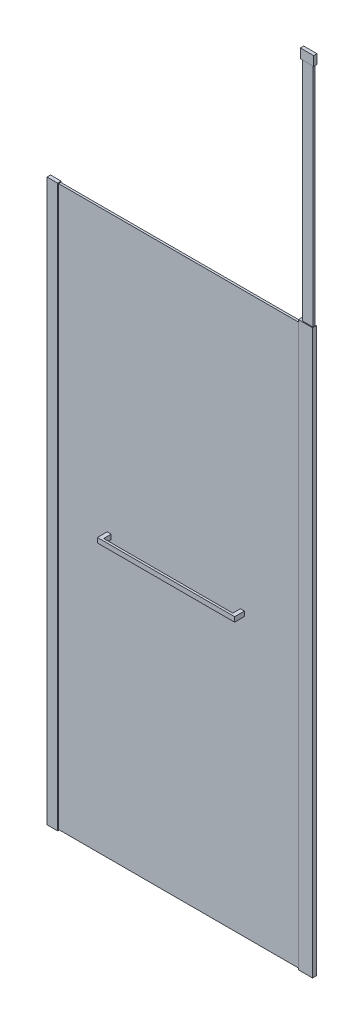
ISO-10303-21;
HEADER;
FILE_DESCRIPTION(('STEP AP214'),'2;1');
FILE_NAME('part.step','',(''),(''),'','','');
FILE_SCHEMA(('AUTOMOTIVE_DESIGN { 1 0 10303 214 1 1 1 1 }'));
ENDSEC;
DATA;
#1=APPLICATION_CONTEXT('core data for automotive mechanical design processes');
#2=APPLICATION_PROTOCOL_DEFINITION('international standard','automotive_design',2000,#1);
#3=PRODUCT_CONTEXT('',#1,'mechanical');
#4=PRODUCT('Part','Part','',(#3));
#5=PRODUCT_RELATED_PRODUCT_CATEGORY('part','',(#4));
#6=PRODUCT_DEFINITION_FORMATION('','',#4);
#7=PRODUCT_DEFINITION_CONTEXT('part definition',#1,'design');
#8=PRODUCT_DEFINITION('design','',#6,#7);
#9=PRODUCT_DEFINITION_SHAPE('','',#8);
#10=(LENGTH_UNIT() NAMED_UNIT(*) SI_UNIT(.MILLI.,.METRE.));
#11=(NAMED_UNIT(*) PLANE_ANGLE_UNIT() SI_UNIT($,.RADIAN.));
#12=(NAMED_UNIT(*) SI_UNIT($,.STERADIAN.) SOLID_ANGLE_UNIT());
#13=UNCERTAINTY_MEASURE_WITH_UNIT(LENGTH_MEASURE(1.E-05),#10,'distance_accuracy_value','');
#14=(GEOMETRIC_REPRESENTATION_CONTEXT(3) GLOBAL_UNCERTAINTY_ASSIGNED_CONTEXT((#13)) GLOBAL_UNIT_ASSIGNED_CONTEXT((#10,
#11,#12)) REPRESENTATION_CONTEXT('',''));
#15=CARTESIAN_POINT('',(0.,0.,0.));
#16=DIRECTION('',(0.,0.,1.));
#17=DIRECTION('',(1.,0.,0.));
#18=AXIS2_PLACEMENT_3D('',#15,#16,#17);
#19=CARTESIAN_POINT('',(237.5,1062.,-21.4));
#20=DIRECTION('',(1.,0.,0.));
#21=DIRECTION('',(0.,0.,-1.));
#22=AXIS2_PLACEMENT_3D('',#19,#20,#21);
#23=PLANE('',#22);
#24=DIRECTION('',(0.,1.,0.));
#25=VECTOR('',#24,1.);
#26=CARTESIAN_POINT('',(237.5,1062.,25.1));
#27=LINE('',#26,#25);
#28=CARTESIAN_POINT('',(237.5,1044.,25.1));
#29=VERTEX_POINT('',#28);
#30=CARTESIAN_POINT('',(237.5,1062.,25.1));
#31=VERTEX_POINT('',#30);
#32=EDGE_CURVE('E63',#29,#31,#27,.T.);
#33=ORIENTED_EDGE('',*,*,#32,.F.);
#34=DIRECTION('',(0.,0.,1.));
#35=VECTOR('',#34,1.);
#36=CARTESIAN_POINT('',(237.5,1044.,-21.4));
#37=LINE('',#36,#35);
#38=CARTESIAN_POINT('',(237.5,1044.,-21.4));
#39=VERTEX_POINT('',#38);
#40=EDGE_CURVE('E12',#39,#29,#37,.T.);
#41=ORIENTED_EDGE('',*,*,#40,.F.);
#42=DIRECTION('',(0.,1.,0.));
#43=VECTOR('',#42,1.);
#44=CARTESIAN_POINT('',(237.5,1062.,-21.4));
#45=LINE('',#44,#43);
#46=CARTESIAN_POINT('',(237.5,1062.,-21.4));
#47=VERTEX_POINT('',#46);
#48=EDGE_CURVE('E193',#39,#47,#45,.T.);
#49=ORIENTED_EDGE('',*,*,#48,.T.);
#50=DIRECTION('',(0.,0.,1.));
#51=VECTOR('',#50,1.);
#52=CARTESIAN_POINT('',(237.5,1062.,-21.4));
#53=LINE('',#52,#51);
#54=EDGE_CURVE('E176',#47,#31,#53,.T.);
#55=ORIENTED_EDGE('',*,*,#54,.T.);
#56=EDGE_LOOP('',(#33,#41,#49,#55));
#57=FACE_BOUND('',#56,.T.);
#58=ADVANCED_FACE('F46',(#57),#23,.T.);
#59=CARTESIAN_POINT('',(222.5,1044.,-21.4));
#60=DIRECTION('',(0.,-1.,0.));
#61=DIRECTION('',(0.,0.,-1.));
#62=AXIS2_PLACEMENT_3D('',#59,#60,#61);
#63=PLANE('',#62);
#64=ORIENTED_EDGE('',*,*,#40,.T.);
#65=DIRECTION('',(-1.,0.,0.));
#66=VECTOR('',#65,1.);
#67=CARTESIAN_POINT('',(742.197715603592,1044.,25.1));
#68=LINE('',#67,#66);
#69=CARTESIAN_POINT('',(722.5,1044.,25.1));
#70=VERTEX_POINT('',#69);
#71=EDGE_CURVE('E166',#70,#29,#68,.T.);
#72=ORIENTED_EDGE('',*,*,#71,.F.);
#73=DIRECTION('',(0.,0.,1.));
#74=VECTOR('',#73,1.);
#75=CARTESIAN_POINT('',(722.5,1044.,-21.4));
#76=LINE('',#75,#74);
#77=CARTESIAN_POINT('',(722.5,1044.,-21.4));
#78=VERTEX_POINT('',#77);
#79=EDGE_CURVE('E149',#78,#70,#76,.T.);
#80=ORIENTED_EDGE('',*,*,#79,.F.);
#81=DIRECTION('',(1.,0.,0.));
#82=VECTOR('',#81,1.);
#83=CARTESIAN_POINT('',(722.5,1044.,-21.4));
#84=LINE('',#83,#82);
#85=CARTESIAN_POINT('',(737.5,1044.,-21.4));
#86=VERTEX_POINT('',#85);
#87=EDGE_CURVE('E131',#78,#86,#84,.T.);
#88=ORIENTED_EDGE('',*,*,#87,.T.);
#89=DIRECTION('',(0.,0.,1.));
#90=VECTOR('',#89,1.);
#91=CARTESIAN_POINT('',(737.5,1044.,-21.4));
#92=LINE('',#91,#90);
#93=CARTESIAN_POINT('',(737.5,1044.,33.1));
#94=VERTEX_POINT('',#93);
#95=EDGE_CURVE('E147',#86,#94,#92,.T.);
#96=ORIENTED_EDGE('',*,*,#95,.T.);
#97=DIRECTION('',(1.,0.,0.));
#98=VECTOR('',#97,1.);
#99=CARTESIAN_POINT('',(222.5,1044.,33.1));
#100=LINE('',#99,#98);
#101=CARTESIAN_POINT('',(222.5,1044.,33.1));
#102=VERTEX_POINT('',#101);
#103=EDGE_CURVE('E135',#102,#94,#100,.T.);
#104=ORIENTED_EDGE('',*,*,#103,.F.);
#105=DIRECTION('',(0.,0.,1.));
#106=VECTOR('',#105,1.);
#107=CARTESIAN_POINT('',(222.5,1044.,-21.4));
#108=LINE('',#107,#106);
#109=CARTESIAN_POINT('',(222.5,1044.,-21.4));
#110=VERTEX_POINT('',#109);
#111=EDGE_CURVE('E55',#110,#102,#108,.T.);
#112=ORIENTED_EDGE('',*,*,#111,.F.);
#113=DIRECTION('',(1.,0.,0.));
#114=VECTOR('',#113,1.);
#115=CARTESIAN_POINT('',(222.5,1044.,-21.4));
#116=LINE('',#115,#114);
#117=EDGE_CURVE('E181',#110,#39,#116,.T.);
#118=ORIENTED_EDGE('',*,*,#117,.T.);
#119=EDGE_LOOP('',(#64,#72,#80,#88,#96,#104,#112,#118));
#120=FACE_BOUND('',#119,.T.);
#121=ADVANCED_FACE('F197',(#120),#63,.T.);
#122=CARTESIAN_POINT('',(222.5,1062.,-21.4));
#123=DIRECTION('',(-1.,0.,0.));
#124=DIRECTION('',(0.,0.,1.));
#125=AXIS2_PLACEMENT_3D('',#122,#123,#124);
#126=PLANE('',#125);
#127=ORIENTED_EDGE('',*,*,#111,.T.);
#128=DIRECTION('',(0.,-1.,0.));
#129=VECTOR('',#128,1.);
#130=CARTESIAN_POINT('',(222.5,1062.,33.1));
#131=LINE('',#130,#129);
#132=CARTESIAN_POINT('',(222.5,1062.,33.1));
#133=VERTEX_POINT('',#132);
#134=EDGE_CURVE('E121',#133,#102,#131,.T.);
#135=ORIENTED_EDGE('',*,*,#134,.F.);
#136=DIRECTION('',(0.,0.,1.));
#137=VECTOR('',#136,1.);
#138=CARTESIAN_POINT('',(222.5,1062.,-21.4));
#139=LINE('',#138,#137);
#140=CARTESIAN_POINT('',(222.5,1062.,-21.4));
#141=VERTEX_POINT('',#140);
#142=EDGE_CURVE('E116',#141,#133,#139,.T.);
#143=ORIENTED_EDGE('',*,*,#142,.F.);
#144=DIRECTION('',(0.,-1.,0.));
#145=VECTOR('',#144,1.);
#146=CARTESIAN_POINT('',(222.5,1062.,-21.4));
#147=LINE('',#146,#145);
#148=EDGE_CURVE('E186',#141,#110,#147,.T.);
#149=ORIENTED_EDGE('',*,*,#148,.T.);
#150=EDGE_LOOP('',(#127,#135,#143,#149));
#151=FACE_BOUND('',#150,.T.);
#152=ADVANCED_FACE('F218',(#151),#126,.T.);
#153=CARTESIAN_POINT('',(222.5,1062.,-21.4));
#154=DIRECTION('',(0.,1.,0.));
#155=DIRECTION('',(0.,0.,1.));
#156=AXIS2_PLACEMENT_3D('',#153,#154,#155);
#157=PLANE('',#156);
#158=ORIENTED_EDGE('',*,*,#142,.T.);
#159=DIRECTION('',(-1.,0.,0.));
#160=VECTOR('',#159,1.);
#161=CARTESIAN_POINT('',(222.5,1062.,33.1));
#162=LINE('',#161,#160);
#163=CARTESIAN_POINT('',(737.5,1062.,33.1));
#164=VERTEX_POINT('',#163);
#165=EDGE_CURVE('E109',#164,#133,#162,.T.);
#166=ORIENTED_EDGE('',*,*,#165,.F.);
#167=DIRECTION('',(0.,0.,1.));
#168=VECTOR('',#167,1.);
#169=CARTESIAN_POINT('',(737.5,1062.,-21.4));
#170=LINE('',#169,#168);
#171=CARTESIAN_POINT('',(737.5,1062.,-21.4));
#172=VERTEX_POINT('',#171);
#173=EDGE_CURVE('E113',#172,#164,#170,.T.);
#174=ORIENTED_EDGE('',*,*,#173,.F.);
#175=DIRECTION('',(-1.,0.,0.));
#176=VECTOR('',#175,1.);
#177=CARTESIAN_POINT('',(722.5,1062.,-21.4));
#178=LINE('',#177,#176);
#179=CARTESIAN_POINT('',(722.5,1062.,-21.4));
#180=VERTEX_POINT('',#179);
#181=EDGE_CURVE('E138',#172,#180,#178,.T.);
#182=ORIENTED_EDGE('',*,*,#181,.T.);
#183=DIRECTION('',(0.,0.,1.));
#184=VECTOR('',#183,1.);
#185=CARTESIAN_POINT('',(722.5,1062.,-21.4));
#186=LINE('',#185,#184);
#187=CARTESIAN_POINT('',(722.5,1062.,25.1));
#188=VERTEX_POINT('',#187);
#189=EDGE_CURVE('E130',#180,#188,#186,.T.);
#190=ORIENTED_EDGE('',*,*,#189,.T.);
#191=DIRECTION('',(-1.,0.,0.));
#192=VECTOR('',#191,1.);
#193=CARTESIAN_POINT('',(742.197715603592,1062.,25.1));
#194=LINE('',#193,#192);
#195=EDGE_CURVE('E163',#188,#31,#194,.T.);
#196=ORIENTED_EDGE('',*,*,#195,.T.);
#197=ORIENTED_EDGE('',*,*,#54,.F.);
#198=DIRECTION('',(-1.,0.,0.));
#199=VECTOR('',#198,1.);
#200=CARTESIAN_POINT('',(222.5,1062.,-21.4));
#201=LINE('',#200,#199);
#202=EDGE_CURVE('E190',#47,#141,#201,.T.);
#203=ORIENTED_EDGE('',*,*,#202,.T.);
#204=EDGE_LOOP('',(#158,#166,#174,#182,#190,#196,#197,#203));
#205=FACE_BOUND('',#204,.T.);
#206=ADVANCED_FACE('F111',(#205),#157,.T.);
#207=CARTESIAN_POINT('',(237.5,1044.,-21.4));
#208=DIRECTION('',(0.,0.,1.));
#209=DIRECTION('',(1.,0.,0.));
#210=AXIS2_PLACEMENT_3D('',#207,#208,#209);
#211=PLANE('',#210);
#212=ORIENTED_EDGE('',*,*,#48,.F.);
#213=ORIENTED_EDGE('',*,*,#117,.F.);
#214=ORIENTED_EDGE('',*,*,#148,.F.);
#215=ORIENTED_EDGE('',*,*,#202,.F.);
#216=EDGE_LOOP('',(#212,#213,#214,#215));
#217=FACE_BOUND('',#216,.T.);
#218=ADVANCED_FACE('F225',(#217),#211,.F.);
#219=CARTESIAN_POINT('',(237.5,1044.,33.1));
#220=DIRECTION('',(0.,0.,1.));
#221=DIRECTION('',(1.,0.,0.));
#222=AXIS2_PLACEMENT_3D('',#219,#220,#221);
#223=PLANE('',#222);
#224=ORIENTED_EDGE('',*,*,#103,.T.);
#225=DIRECTION('',(0.,1.,0.));
#226=VECTOR('',#225,1.);
#227=CARTESIAN_POINT('',(737.5,1062.,33.1));
#228=LINE('',#227,#226);
#229=EDGE_CURVE('E127',#94,#164,#228,.T.);
#230=ORIENTED_EDGE('',*,*,#229,.T.);
#231=ORIENTED_EDGE('',*,*,#165,.T.);
#232=ORIENTED_EDGE('',*,*,#134,.T.);
#233=EDGE_LOOP('',(#224,#230,#231,#232));
#234=FACE_BOUND('',#233,.T.);
#235=ADVANCED_FACE('F133',(#234),#223,.T.);
#236=CARTESIAN_POINT('',(742.197715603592,1062.,25.1));
#237=DIRECTION('',(0.,0.,1.));
#238=DIRECTION('',(1.,0.,0.));
#239=AXIS2_PLACEMENT_3D('',#236,#237,#238);
#240=PLANE('',#239);
#241=ORIENTED_EDGE('',*,*,#195,.F.);
#242=DIRECTION('',(0.,-1.,0.));
#243=VECTOR('',#242,1.);
#244=CARTESIAN_POINT('',(722.5,1062.,25.1));
#245=LINE('',#244,#243);
#246=EDGE_CURVE('E49',#188,#70,#245,.T.);
#247=ORIENTED_EDGE('',*,*,#246,.T.);
#248=ORIENTED_EDGE('',*,*,#71,.T.);
#249=ORIENTED_EDGE('',*,*,#32,.T.);
#250=EDGE_LOOP('',(#241,#247,#248,#249));
#251=FACE_BOUND('',#250,.T.);
#252=ADVANCED_FACE('F203',(#251),#240,.F.);
#253=CARTESIAN_POINT('',(722.5,1062.,-21.4));
#254=DIRECTION('',(-1.,0.,0.));
#255=DIRECTION('',(0.,0.,1.));
#256=AXIS2_PLACEMENT_3D('',#253,#254,#255);
#257=PLANE('',#256);
#258=ORIENTED_EDGE('',*,*,#246,.F.);
#259=ORIENTED_EDGE('',*,*,#189,.F.);
#260=DIRECTION('',(0.,-1.,0.));
#261=VECTOR('',#260,1.);
#262=CARTESIAN_POINT('',(722.5,1062.,-21.4));
#263=LINE('',#262,#261);
#264=EDGE_CURVE('E142',#180,#78,#263,.T.);
#265=ORIENTED_EDGE('',*,*,#264,.T.);
#266=ORIENTED_EDGE('',*,*,#79,.T.);
#267=EDGE_LOOP('',(#258,#259,#265,#266));
#268=FACE_BOUND('',#267,.T.);
#269=ADVANCED_FACE('F204',(#268),#257,.T.);
#270=CARTESIAN_POINT('',(737.5,1062.,-21.4));
#271=DIRECTION('',(1.,0.,0.));
#272=DIRECTION('',(0.,0.,-1.));
#273=AXIS2_PLACEMENT_3D('',#270,#271,#272);
#274=PLANE('',#273);
#275=ORIENTED_EDGE('',*,*,#173,.T.);
#276=ORIENTED_EDGE('',*,*,#229,.F.);
#277=ORIENTED_EDGE('',*,*,#95,.F.);
#278=DIRECTION('',(0.,1.,0.));
#279=VECTOR('',#278,1.);
#280=CARTESIAN_POINT('',(737.5,1062.,-21.4));
#281=LINE('',#280,#279);
#282=EDGE_CURVE('E129',#86,#172,#281,.T.);
#283=ORIENTED_EDGE('',*,*,#282,.T.);
#284=EDGE_LOOP('',(#275,#276,#277,#283));
#285=FACE_BOUND('',#284,.T.);
#286=ADVANCED_FACE('F126',(#285),#274,.T.);
#287=CARTESIAN_POINT('',(737.5,1044.,-21.4));
#288=DIRECTION('',(0.,0.,1.));
#289=DIRECTION('',(1.,0.,0.));
#290=AXIS2_PLACEMENT_3D('',#287,#288,#289);
#291=PLANE('',#290);
#292=ORIENTED_EDGE('',*,*,#282,.F.);
#293=ORIENTED_EDGE('',*,*,#87,.F.);
#294=ORIENTED_EDGE('',*,*,#264,.F.);
#295=ORIENTED_EDGE('',*,*,#181,.F.);
#296=EDGE_LOOP('',(#292,#293,#294,#295));
#297=FACE_BOUND('',#296,.T.);
#298=ADVANCED_FACE('F200',(#297),#291,.F.);
#299=CLOSED_SHELL('',(#58,#121,#152,#206,#218,#235,#252,#269,#286,#298));
#300=MANIFOLD_SOLID_BREP('B2',#299);
#301=CARTESIAN_POINT('',(949.9,3000.,-1.15000000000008));
#302=DIRECTION('',(1.,0.,0.));
#303=DIRECTION('',(0.,1.,0.));
#304=AXIS2_PLACEMENT_3D('',#301,#302,#303);
#305=PLANE('',#304);
#306=DIRECTION('',(0.,0.,1.));
#307=VECTOR('',#306,1.);
#308=CARTESIAN_POINT('',(949.9,2965.,-1.15000000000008));
#309=LINE('',#308,#307);
#310=CARTESIAN_POINT('',(949.9,2965.,-13.6500000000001));
#311=VERTEX_POINT('',#310);
#312=CARTESIAN_POINT('',(949.9,2965.,-1.15000000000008));
#313=VERTEX_POINT('',#312);
#314=EDGE_CURVE('E406',#311,#313,#309,.T.);
#315=ORIENTED_EDGE('',*,*,#314,.T.);
#316=DIRECTION('',(0.,-1.,0.));
#317=VECTOR('',#316,1.);
#318=CARTESIAN_POINT('',(949.9,3000.,-1.15000000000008));
#319=LINE('',#318,#317);
#320=CARTESIAN_POINT('',(949.9,3000.,-1.15000000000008));
#321=VERTEX_POINT('',#320);
#322=EDGE_CURVE('E387',#321,#313,#319,.T.);
#323=ORIENTED_EDGE('',*,*,#322,.F.);
#324=DIRECTION('',(0.,0.,1.));
#325=VECTOR('',#324,1.);
#326=CARTESIAN_POINT('',(949.9,3000.,-1.15000000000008));
#327=LINE('',#326,#325);
#328=CARTESIAN_POINT('',(949.9,3000.,-13.6500000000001));
#329=VERTEX_POINT('',#328);
#330=EDGE_CURVE('E394',#329,#321,#327,.T.);
#331=ORIENTED_EDGE('',*,*,#330,.F.);
#332=DIRECTION('',(0.,-1.,0.));
#333=VECTOR('',#332,1.);
#334=CARTESIAN_POINT('',(949.9,3000.,-13.6500000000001));
#335=LINE('',#334,#333);
#336=EDGE_CURVE('E545',#329,#311,#335,.T.);
#337=ORIENTED_EDGE('',*,*,#336,.T.);
#338=EDGE_LOOP('',(#315,#323,#331,#337));
#339=FACE_BOUND('',#338,.T.);
#340=ADVANCED_FACE('F318',(#339),#305,.F.);
#341=CARTESIAN_POINT('',(999.9,3000.,-1.15000000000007));
#342=DIRECTION('',(0.,0.,-1.));
#343=DIRECTION('',(-1.,0.,0.));
#344=AXIS2_PLACEMENT_3D('',#341,#342,#343);
#345=PLANE('',#344);
#346=DIRECTION('',(1.,0.,0.));
#347=VECTOR('',#346,1.);
#348=CARTESIAN_POINT('',(999.9,2965.,-1.15000000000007));
#349=LINE('',#348,#347);
#350=CARTESIAN_POINT('',(999.9,2965.,-1.15000000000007));
#351=VERTEX_POINT('',#350);
#352=EDGE_CURVE('E543',#313,#351,#349,.T.);
#353=ORIENTED_EDGE('',*,*,#352,.T.);
#354=DIRECTION('',(0.,-1.,0.));
#355=VECTOR('',#354,1.);
#356=CARTESIAN_POINT('',(999.9,3000.,-1.15000000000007));
#357=LINE('',#356,#355);
#358=CARTESIAN_POINT('',(999.9,3000.,-1.15000000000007));
#359=VERTEX_POINT('',#358);
#360=EDGE_CURVE('E390',#359,#351,#357,.T.);
#361=ORIENTED_EDGE('',*,*,#360,.F.);
#362=DIRECTION('',(1.,0.,0.));
#363=VECTOR('',#362,1.);
#364=CARTESIAN_POINT('',(999.9,3000.,-1.15000000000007));
#365=LINE('',#364,#363);
#366=EDGE_CURVE('E383',#321,#359,#365,.T.);
#367=ORIENTED_EDGE('',*,*,#366,.F.);
#368=ORIENTED_EDGE('',*,*,#322,.T.);
#369=EDGE_LOOP('',(#353,#361,#367,#368));
#370=FACE_BOUND('',#369,.T.);
#371=ADVANCED_FACE('F385',(#370),#345,.F.);
#372=CARTESIAN_POINT('',(999.9,3000.,-1.15000000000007));
#373=DIRECTION('',(-1.,0.,0.));
#374=DIRECTION('',(0.,-1.,0.));
#375=AXIS2_PLACEMENT_3D('',#372,#373,#374);
#376=PLANE('',#375);
#377=DIRECTION('',(0.,0.,-1.));
#378=VECTOR('',#377,1.);
#379=CARTESIAN_POINT('',(999.9,2965.,-1.15000000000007));
#380=LINE('',#379,#378);
#381=CARTESIAN_POINT('',(999.9,2965.,-13.6500000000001));
#382=VERTEX_POINT('',#381);
#383=EDGE_CURVE('E539',#351,#382,#380,.T.);
#384=ORIENTED_EDGE('',*,*,#383,.T.);
#385=DIRECTION('',(0.,-1.,0.));
#386=VECTOR('',#385,1.);
#387=CARTESIAN_POINT('',(999.9,3000.,-13.6500000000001));
#388=LINE('',#387,#386);
#389=CARTESIAN_POINT('',(999.9,3000.,-13.6500000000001));
#390=VERTEX_POINT('',#389);
#391=EDGE_CURVE('E410',#390,#382,#388,.T.);
#392=ORIENTED_EDGE('',*,*,#391,.F.);
#393=DIRECTION('',(0.,0.,-1.));
#394=VECTOR('',#393,1.);
#395=CARTESIAN_POINT('',(999.9,3000.,-1.15000000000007));
#396=LINE('',#395,#394);
#397=EDGE_CURVE('E393',#359,#390,#396,.T.);
#398=ORIENTED_EDGE('',*,*,#397,.F.);
#399=ORIENTED_EDGE('',*,*,#360,.T.);
#400=EDGE_LOOP('',(#384,#392,#398,#399));
#401=FACE_BOUND('',#400,.T.);
#402=ADVANCED_FACE('F460',(#401),#376,.F.);
#403=CARTESIAN_POINT('',(999.9,3000.,-13.6500000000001));
#404=DIRECTION('',(0.,0.,1.));
#405=DIRECTION('',(1.,0.,0.));
#406=AXIS2_PLACEMENT_3D('',#403,#404,#405);
#407=PLANE('',#406);
#408=DIRECTION('',(-1.,0.,0.));
#409=VECTOR('',#408,1.);
#410=CARTESIAN_POINT('',(999.9,2965.,-13.6500000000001));
#411=LINE('',#410,#409);
#412=EDGE_CURVE('E403',#382,#311,#411,.T.);
#413=ORIENTED_EDGE('',*,*,#412,.T.);
#414=ORIENTED_EDGE('',*,*,#336,.F.);
#415=DIRECTION('',(-1.,0.,0.));
#416=VECTOR('',#415,1.);
#417=CARTESIAN_POINT('',(999.9,3000.,-13.6500000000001));
#418=LINE('',#417,#416);
#419=EDGE_CURVE('E399',#390,#329,#418,.T.);
#420=ORIENTED_EDGE('',*,*,#419,.F.);
#421=ORIENTED_EDGE('',*,*,#391,.T.);
#422=EDGE_LOOP('',(#413,#414,#420,#421));
#423=FACE_BOUND('',#422,.T.);
#424=ADVANCED_FACE('F507',(#423),#407,.F.);
#425=CARTESIAN_POINT('',(949.9,3000.,-13.6500000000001));
#426=DIRECTION('',(0.,1.,0.));
#427=DIRECTION('',(0.,0.,1.));
#428=AXIS2_PLACEMENT_3D('',#425,#426,#427);
#429=PLANE('',#428);
#430=ORIENTED_EDGE('',*,*,#330,.T.);
#431=ORIENTED_EDGE('',*,*,#366,.T.);
#432=ORIENTED_EDGE('',*,*,#397,.T.);
#433=ORIENTED_EDGE('',*,*,#419,.T.);
#434=EDGE_LOOP('',(#430,#431,#432,#433));
#435=FACE_BOUND('',#434,.T.);
#436=ADVANCED_FACE('F397',(#435),#429,.T.);
#437=CARTESIAN_POINT('',(949.9,2965.,-13.6500000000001));
#438=DIRECTION('',(0.,1.,0.));
#439=DIRECTION('',(0.,0.,1.));
#440=AXIS2_PLACEMENT_3D('',#437,#438,#439);
#441=PLANE('',#440);
#442=DIRECTION('',(0.,0.,1.));
#443=VECTOR('',#442,1.);
#444=CARTESIAN_POINT('',(994.9,2965.,-11.4000000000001));
#445=LINE('',#444,#443);
#446=CARTESIAN_POINT('',(994.9,2965.,-11.4000000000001));
#447=VERTEX_POINT('',#446);
#448=CARTESIAN_POINT('',(994.9,2965.,-3.40000000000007));
#449=VERTEX_POINT('',#448);
#450=EDGE_CURVE('E415',#447,#449,#445,.T.);
#451=ORIENTED_EDGE('',*,*,#450,.F.);
#452=DIRECTION('',(1.,0.,0.));
#453=VECTOR('',#452,1.);
#454=CARTESIAN_POINT('',(994.9,2965.,-11.4000000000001));
#455=LINE('',#454,#453);
#456=CARTESIAN_POINT('',(954.9,2965.,-11.4000000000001));
#457=VERTEX_POINT('',#456);
#458=EDGE_CURVE('E408',#457,#447,#455,.T.);
#459=ORIENTED_EDGE('',*,*,#458,.F.);
#460=DIRECTION('',(0.,0.,-1.));
#461=VECTOR('',#460,1.);
#462=CARTESIAN_POINT('',(954.9,2965.,-11.4000000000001));
#463=LINE('',#462,#461);
#464=CARTESIAN_POINT('',(954.9,2965.,-3.40000000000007));
#465=VERTEX_POINT('',#464);
#466=EDGE_CURVE('E333',#465,#457,#463,.T.);
#467=ORIENTED_EDGE('',*,*,#466,.F.);
#468=DIRECTION('',(-1.,0.,0.));
#469=VECTOR('',#468,1.);
#470=CARTESIAN_POINT('',(994.9,2965.,-3.40000000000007));
#471=LINE('',#470,#469);
#472=EDGE_CURVE('E44',#449,#465,#471,.T.);
#473=ORIENTED_EDGE('',*,*,#472,.F.);
#474=EDGE_LOOP('',(#451,#459,#467,#473));
#475=FACE_BOUND('',#474,.T.);
#476=ORIENTED_EDGE('',*,*,#314,.F.);
#477=ORIENTED_EDGE('',*,*,#412,.F.);
#478=ORIENTED_EDGE('',*,*,#383,.F.);
#479=ORIENTED_EDGE('',*,*,#352,.F.);
#480=EDGE_LOOP('',(#476,#477,#478,#479));
#481=FACE_BOUND('',#480,.T.);
#482=ADVANCED_FACE('F490',(#475,#481),#441,.F.);
#483=CARTESIAN_POINT('',(994.9,2997.,-11.4000000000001));
#484=DIRECTION('',(1.,0.,0.));
#485=DIRECTION('',(0.,0.,-1.));
#486=AXIS2_PLACEMENT_3D('',#483,#484,#485);
#487=PLANE('',#486);
#488=DIRECTION('',(0.,-1.,0.));
#489=VECTOR('',#488,1.);
#490=CARTESIAN_POINT('',(994.9,2997.,-11.4000000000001));
#491=LINE('',#490,#489);
#492=CARTESIAN_POINT('',(994.9,2114.,-11.4000000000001));
#493=VERTEX_POINT('',#492);
#494=EDGE_CURVE('E326',#447,#493,#491,.T.);
#495=ORIENTED_EDGE('',*,*,#494,.F.);
#496=ORIENTED_EDGE('',*,*,#450,.T.);
#497=DIRECTION('',(0.,-1.,0.));
#498=VECTOR('',#497,1.);
#499=CARTESIAN_POINT('',(994.9,2997.,-3.40000000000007));
#500=LINE('',#499,#498);
#501=CARTESIAN_POINT('',(994.9,2114.,-3.40000000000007));
#502=VERTEX_POINT('',#501);
#503=EDGE_CURVE('E430',#449,#502,#500,.T.);
#504=ORIENTED_EDGE('',*,*,#503,.T.);
#505=DIRECTION('',(0.,0.,1.));
#506=VECTOR('',#505,1.);
#507=CARTESIAN_POINT('',(994.9,2114.,-11.4000000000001));
#508=LINE('',#507,#506);
#509=EDGE_CURVE('E418',#493,#502,#508,.T.);
#510=ORIENTED_EDGE('',*,*,#509,.F.);
#511=EDGE_LOOP('',(#495,#496,#504,#510));
#512=FACE_BOUND('',#511,.T.);
#513=ADVANCED_FACE('F320',(#512),#487,.T.);
#514=CARTESIAN_POINT('',(994.9,2997.,-11.4000000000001));
#515=DIRECTION('',(0.,0.,-1.));
#516=DIRECTION('',(-1.,0.,0.));
#517=AXIS2_PLACEMENT_3D('',#514,#515,#516);
#518=PLANE('',#517);
#519=DIRECTION('',(0.,-1.,0.));
#520=VECTOR('',#519,1.);
#521=CARTESIAN_POINT('',(954.9,2997.,-11.4000000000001));
#522=LINE('',#521,#520);
#523=CARTESIAN_POINT('',(954.9,2114.,-11.4000000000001));
#524=VERTEX_POINT('',#523);
#525=EDGE_CURVE('E432',#457,#524,#522,.T.);
#526=ORIENTED_EDGE('',*,*,#525,.F.);
#527=ORIENTED_EDGE('',*,*,#458,.T.);
#528=ORIENTED_EDGE('',*,*,#494,.T.);
#529=DIRECTION('',(1.,0.,0.));
#530=VECTOR('',#529,1.);
#531=CARTESIAN_POINT('',(994.9,2114.,-11.4000000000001));
#532=LINE('',#531,#530);
#533=EDGE_CURVE('E427',#524,#493,#532,.T.);
#534=ORIENTED_EDGE('',*,*,#533,.F.);
#535=EDGE_LOOP('',(#526,#527,#528,#534));
#536=FACE_BOUND('',#535,.T.);
#537=ADVANCED_FACE('F445',(#536),#518,.T.);
#538=CARTESIAN_POINT('',(954.9,2997.,-11.4000000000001));
#539=DIRECTION('',(-1.,0.,0.));
#540=DIRECTION('',(0.,0.,1.));
#541=AXIS2_PLACEMENT_3D('',#538,#539,#540);
#542=PLANE('',#541);
#543=DIRECTION('',(0.,-1.,0.));
#544=VECTOR('',#543,1.);
#545=CARTESIAN_POINT('',(954.9,2997.,-3.40000000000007));
#546=LINE('',#545,#544);
#547=CARTESIAN_POINT('',(954.9,2114.,-3.40000000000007));
#548=VERTEX_POINT('',#547);
#549=EDGE_CURVE('E434',#465,#548,#546,.T.);
#550=ORIENTED_EDGE('',*,*,#549,.F.);
#551=ORIENTED_EDGE('',*,*,#466,.T.);
#552=ORIENTED_EDGE('',*,*,#525,.T.);
#553=DIRECTION('',(0.,0.,-1.));
#554=VECTOR('',#553,1.);
#555=CARTESIAN_POINT('',(954.9,2114.,-11.4000000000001));
#556=LINE('',#555,#554);
#557=EDGE_CURVE('E424',#548,#524,#556,.T.);
#558=ORIENTED_EDGE('',*,*,#557,.F.);
#559=EDGE_LOOP('',(#550,#551,#552,#558));
#560=FACE_BOUND('',#559,.T.);
#561=ADVANCED_FACE('F447',(#560),#542,.T.);
#562=CARTESIAN_POINT('',(994.9,2997.,-3.40000000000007));
#563=DIRECTION('',(0.,0.,1.));
#564=DIRECTION('',(1.,0.,0.));
#565=AXIS2_PLACEMENT_3D('',#562,#563,#564);
#566=PLANE('',#565);
#567=ORIENTED_EDGE('',*,*,#503,.F.);
#568=ORIENTED_EDGE('',*,*,#472,.T.);
#569=ORIENTED_EDGE('',*,*,#549,.T.);
#570=DIRECTION('',(-1.,0.,0.));
#571=VECTOR('',#570,1.);
#572=CARTESIAN_POINT('',(994.9,2114.,-3.40000000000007));
#573=LINE('',#572,#571);
#574=EDGE_CURVE('E421',#502,#548,#573,.T.);
#575=ORIENTED_EDGE('',*,*,#574,.F.);
#576=EDGE_LOOP('',(#567,#568,#569,#575));
#577=FACE_BOUND('',#576,.T.);
#578=ADVANCED_FACE('F439',(#577),#566,.T.);
#579=CARTESIAN_POINT('',(994.9,2114.,-3.40000000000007));
#580=DIRECTION('',(0.,-1.,0.));
#581=DIRECTION('',(0.,0.,-1.));
#582=AXIS2_PLACEMENT_3D('',#579,#580,#581);
#583=PLANE('',#582);
#584=ORIENTED_EDGE('',*,*,#509,.T.);
#585=ORIENTED_EDGE('',*,*,#574,.T.);
#586=ORIENTED_EDGE('',*,*,#557,.T.);
#587=ORIENTED_EDGE('',*,*,#533,.T.);
#588=EDGE_LOOP('',(#584,#585,#586,#587));
#589=FACE_BOUND('',#588,.T.);
#590=ADVANCED_FACE('F443',(#589),#583,.T.);
#591=CLOSED_SHELL('',(#340,#371,#402,#424,#436,#482,#513,#537,#561,#578,#590));
#592=MANIFOLD_SOLID_BREP('B6',#591);
#593=CARTESIAN_POINT('',(953.5,2111.,-3.39999999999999));
#594=DIRECTION('',(0.,0.,-1.));
#595=DIRECTION('',(-1.,0.,0.));
#596=AXIS2_PLACEMENT_3D('',#593,#594,#595);
#597=PLANE('',#596);
#598=DIRECTION('',(-1.,0.,0.));
#599=VECTOR('',#598,1.);
#600=CARTESIAN_POINT('',(953.5,2103.2,-3.39999999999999));
#601=LINE('',#600,#599);
#602=CARTESIAN_POINT('',(953.5,2103.2,-3.39999999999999));
#603=VERTEX_POINT('',#602);
#604=CARTESIAN_POINT('',(943.4,2103.2,-3.39999999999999));
#605=VERTEX_POINT('',#604);
#606=EDGE_CURVE('E672',#603,#605,#601,.T.);
#607=ORIENTED_EDGE('',*,*,#606,.F.);
#608=DIRECTION('',(0.,-1.,0.));
#609=VECTOR('',#608,1.);
#610=CARTESIAN_POINT('',(953.5,2111.,-3.39999999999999));
#611=LINE('',#610,#609);
#612=CARTESIAN_POINT('',(953.5,3.,-3.39999999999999));
#613=VERTEX_POINT('',#612);
#614=EDGE_CURVE('E695',#603,#613,#611,.T.);
#615=ORIENTED_EDGE('',*,*,#614,.T.);
#616=DIRECTION('',(1.,0.,0.));
#617=VECTOR('',#616,1.);
#618=CARTESIAN_POINT('',(953.5,3.,-3.39999999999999));
#619=LINE('',#618,#617);
#620=CARTESIAN_POINT('',(943.4,3.,-3.39999999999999));
#621=VERTEX_POINT('',#620);
#622=EDGE_CURVE('E683',#621,#613,#619,.T.);
#623=ORIENTED_EDGE('',*,*,#622,.F.);
#624=DIRECTION('',(0.,-1.,0.));
#625=VECTOR('',#624,1.);
#626=CARTESIAN_POINT('',(943.4,2111.,-3.39999999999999));
#627=LINE('',#626,#625);
#628=EDGE_CURVE('E575',#605,#621,#627,.T.);
#629=ORIENTED_EDGE('',*,*,#628,.F.);
#630=EDGE_LOOP('',(#607,#615,#623,#629));
#631=FACE_BOUND('',#630,.T.);
#632=ADVANCED_FACE('F567',(#631),#597,.T.);
#633=CARTESIAN_POINT('',(943.4,2111.,-3.39999999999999));
#634=DIRECTION('',(-1.,0.,0.));
#635=DIRECTION('',(0.,0.,1.));
#636=AXIS2_PLACEMENT_3D('',#633,#634,#635);
#637=PLANE('',#636);
#638=DIRECTION('',(0.,-1.,0.));
#639=VECTOR('',#638,1.);
#640=CARTESIAN_POINT('',(943.4,2111.,-14.4));
#641=LINE('',#640,#639);
#642=CARTESIAN_POINT('',(943.4,2114.,-14.4));
#643=VERTEX_POINT('',#642);
#644=CARTESIAN_POINT('',(943.4,0.,-14.4));
#645=VERTEX_POINT('',#644);
#646=EDGE_CURVE('E635',#643,#645,#641,.T.);
#647=ORIENTED_EDGE('',*,*,#646,.T.);
#648=DIRECTION('',(0.,0.,-1.));
#649=VECTOR('',#648,1.);
#650=CARTESIAN_POINT('',(943.4,0.,-0.399999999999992));
#651=LINE('',#650,#649);
#652=CARTESIAN_POINT('',(943.4,0.,-0.399999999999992));
#653=VERTEX_POINT('',#652);
#654=EDGE_CURVE('E639',#653,#645,#651,.T.);
#655=ORIENTED_EDGE('',*,*,#654,.F.);
#656=DIRECTION('',(0.,-1.,0.));
#657=VECTOR('',#656,1.);
#658=CARTESIAN_POINT('',(943.4,2111.,-0.399999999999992));
#659=LINE('',#658,#657);
#660=CARTESIAN_POINT('',(943.4,2114.,-0.399999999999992));
#661=VERTEX_POINT('',#660);
#662=EDGE_CURVE('E690',#661,#653,#659,.T.);
#663=ORIENTED_EDGE('',*,*,#662,.F.);
#664=DIRECTION('',(0.,0.,1.));
#665=VECTOR('',#664,1.);
#666=CARTESIAN_POINT('',(943.4,2114.,-14.4));
#667=LINE('',#666,#665);
#668=EDGE_CURVE('E641',#643,#661,#667,.T.);
#669=ORIENTED_EDGE('',*,*,#668,.F.);
#670=EDGE_LOOP('',(#647,#655,#663,#669));
#671=FACE_BOUND('',#670,.T.);
#672=DIRECTION('',(0.,0.,1.));
#673=VECTOR('',#672,1.);
#674=CARTESIAN_POINT('',(943.4,2103.2,-3.34999999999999));
#675=LINE('',#674,#673);
#676=CARTESIAN_POINT('',(943.4,2103.2,-11.4));
#677=VERTEX_POINT('',#676);
#678=EDGE_CURVE('E666',#677,#605,#675,.T.);
#679=ORIENTED_EDGE('',*,*,#678,.T.);
#680=ORIENTED_EDGE('',*,*,#628,.T.);
#681=DIRECTION('',(0.,0.,-1.));
#682=VECTOR('',#681,1.);
#683=CARTESIAN_POINT('',(943.4,3.,-0.399999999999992));
#684=LINE('',#683,#682);
#685=CARTESIAN_POINT('',(943.4,3.,-11.4));
#686=VERTEX_POINT('',#685);
#687=EDGE_CURVE('E660',#621,#686,#684,.T.);
#688=ORIENTED_EDGE('',*,*,#687,.T.);
#689=DIRECTION('',(0.,-1.,0.));
#690=VECTOR('',#689,1.);
#691=CARTESIAN_POINT('',(943.4,2111.,-11.4));
#692=LINE('',#691,#690);
#693=EDGE_CURVE('E646',#677,#686,#692,.T.);
#694=ORIENTED_EDGE('',*,*,#693,.F.);
#695=EDGE_LOOP('',(#679,#680,#688,#694));
#696=FACE_BOUND('',#695,.T.);
#697=ADVANCED_FACE('F637',(#671,#696),#637,.T.);
#698=CARTESIAN_POINT('',(943.4,2111.,-0.399999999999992));
#699=DIRECTION('',(0.,0.,1.));
#700=DIRECTION('',(1.,0.,0.));
#701=AXIS2_PLACEMENT_3D('',#698,#699,#700);
#702=PLANE('',#701);
#703=ORIENTED_EDGE('',*,*,#662,.T.);
#704=DIRECTION('',(-1.,0.,0.));
#705=VECTOR('',#704,1.);
#706=CARTESIAN_POINT('',(943.4,0.,-0.399999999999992));
#707=LINE('',#706,#705);
#708=CARTESIAN_POINT('',(996.4,0.,-0.399999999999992));
#709=VERTEX_POINT('',#708);
#710=EDGE_CURVE('E659',#709,#653,#707,.T.);
#711=ORIENTED_EDGE('',*,*,#710,.F.);
#712=DIRECTION('',(0.,-1.,0.));
#713=VECTOR('',#712,1.);
#714=CARTESIAN_POINT('',(996.4,2111.,-0.399999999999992));
#715=LINE('',#714,#713);
#716=CARTESIAN_POINT('',(996.4,2114.,-0.399999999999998));
#717=VERTEX_POINT('',#716);
#718=EDGE_CURVE('E782',#717,#709,#715,.T.);
#719=ORIENTED_EDGE('',*,*,#718,.F.);
#720=DIRECTION('',(1.,0.,0.));
#721=VECTOR('',#720,1.);
#722=CARTESIAN_POINT('',(996.4,2114.,-0.399999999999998));
#723=LINE('',#722,#721);
#724=EDGE_CURVE('E680',#661,#717,#723,.T.);
#725=ORIENTED_EDGE('',*,*,#724,.F.);
#726=EDGE_LOOP('',(#703,#711,#719,#725));
#727=FACE_BOUND('',#726,.T.);
#728=ADVANCED_FACE('F723',(#727),#702,.T.);
#729=CARTESIAN_POINT('',(996.4,2111.,-0.399999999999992));
#730=DIRECTION('',(1.,0.,0.));
#731=DIRECTION('',(0.,0.,-1.));
#732=AXIS2_PLACEMENT_3D('',#729,#730,#731);
#733=PLANE('',#732);
#734=ORIENTED_EDGE('',*,*,#718,.T.);
#735=DIRECTION('',(0.,0.,1.));
#736=VECTOR('',#735,1.);
#737=CARTESIAN_POINT('',(996.4,0.,-0.399999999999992));
#738=LINE('',#737,#736);
#739=CARTESIAN_POINT('',(996.4,0.,-14.4));
#740=VERTEX_POINT('',#739);
#741=EDGE_CURVE('E654',#740,#709,#738,.T.);
#742=ORIENTED_EDGE('',*,*,#741,.F.);
#743=DIRECTION('',(0.,-1.,0.));
#744=VECTOR('',#743,1.);
#745=CARTESIAN_POINT('',(996.4,2111.,-14.4));
#746=LINE('',#745,#744);
#747=CARTESIAN_POINT('',(996.4,2114.,-14.4));
#748=VERTEX_POINT('',#747);
#749=EDGE_CURVE('E645',#748,#740,#746,.T.);
#750=ORIENTED_EDGE('',*,*,#749,.F.);
#751=DIRECTION('',(0.,0.,-1.));
#752=VECTOR('',#751,1.);
#753=CARTESIAN_POINT('',(996.4,2114.,-14.4));
#754=LINE('',#753,#752);
#755=EDGE_CURVE('E674',#717,#748,#754,.T.);
#756=ORIENTED_EDGE('',*,*,#755,.F.);
#757=EDGE_LOOP('',(#734,#742,#750,#756));
#758=FACE_BOUND('',#757,.T.);
#759=ADVANCED_FACE('F728',(#758),#733,.T.);
#760=CARTESIAN_POINT('',(996.4,2111.,-14.4));
#761=DIRECTION('',(0.,0.,-1.));
#762=DIRECTION('',(-1.,0.,0.));
#763=AXIS2_PLACEMENT_3D('',#760,#761,#762);
#764=PLANE('',#763);
#765=ORIENTED_EDGE('',*,*,#749,.T.);
#766=DIRECTION('',(1.,0.,0.));
#767=VECTOR('',#766,1.);
#768=CARTESIAN_POINT('',(943.4,0.,-14.4));
#769=LINE('',#768,#767);
#770=EDGE_CURVE('E649',#645,#740,#769,.T.);
#771=ORIENTED_EDGE('',*,*,#770,.F.);
#772=ORIENTED_EDGE('',*,*,#646,.F.);
#773=DIRECTION('',(-1.,0.,0.));
#774=VECTOR('',#773,1.);
#775=CARTESIAN_POINT('',(996.4,2114.,-14.4));
#776=LINE('',#775,#774);
#777=EDGE_CURVE('E677',#748,#643,#776,.T.);
#778=ORIENTED_EDGE('',*,*,#777,.F.);
#779=EDGE_LOOP('',(#765,#771,#772,#778));
#780=FACE_BOUND('',#779,.T.);
#781=ADVANCED_FACE('F650',(#780),#764,.T.);
#782=CARTESIAN_POINT('',(943.4,2111.,-11.4));
#783=DIRECTION('',(0.,0.,1.));
#784=DIRECTION('',(1.,0.,0.));
#785=AXIS2_PLACEMENT_3D('',#782,#783,#784);
#786=PLANE('',#785);
#787=DIRECTION('',(1.,0.,0.));
#788=VECTOR('',#787,1.);
#789=CARTESIAN_POINT('',(943.4,2103.2,-11.4));
#790=LINE('',#789,#788);
#791=CARTESIAN_POINT('',(953.5,2103.2,-11.4));
#792=VERTEX_POINT('',#791);
#793=EDGE_CURVE('E670',#677,#792,#790,.T.);
#794=ORIENTED_EDGE('',*,*,#793,.F.);
#795=ORIENTED_EDGE('',*,*,#693,.T.);
#796=DIRECTION('',(-1.,0.,0.));
#797=VECTOR('',#796,1.);
#798=CARTESIAN_POINT('',(943.4,3.,-11.4));
#799=LINE('',#798,#797);
#800=CARTESIAN_POINT('',(953.5,3.,-11.4));
#801=VERTEX_POINT('',#800);
#802=EDGE_CURVE('E687',#801,#686,#799,.T.);
#803=ORIENTED_EDGE('',*,*,#802,.F.);
#804=DIRECTION('',(0.,-1.,0.));
#805=VECTOR('',#804,1.);
#806=CARTESIAN_POINT('',(953.5,2111.,-11.4));
#807=LINE('',#806,#805);
#808=EDGE_CURVE('E590',#792,#801,#807,.T.);
#809=ORIENTED_EDGE('',*,*,#808,.F.);
#810=EDGE_LOOP('',(#794,#795,#803,#809));
#811=FACE_BOUND('',#810,.T.);
#812=ADVANCED_FACE('F709',(#811),#786,.T.);
#813=CARTESIAN_POINT('',(953.5,2111.,-11.4));
#814=DIRECTION('',(-1.,0.,0.));
#815=DIRECTION('',(0.,0.,1.));
#816=AXIS2_PLACEMENT_3D('',#813,#814,#815);
#817=PLANE('',#816);
#818=DIRECTION('',(0.,0.,1.));
#819=VECTOR('',#818,1.);
#820=CARTESIAN_POINT('',(953.5,2103.2,-11.4));
#821=LINE('',#820,#819);
#822=EDGE_CURVE('E316',#792,#603,#821,.T.);
#823=ORIENTED_EDGE('',*,*,#822,.F.);
#824=ORIENTED_EDGE('',*,*,#808,.T.);
#825=DIRECTION('',(0.,0.,-1.));
#826=VECTOR('',#825,1.);
#827=CARTESIAN_POINT('',(953.5,3.,-11.4));
#828=LINE('',#827,#826);
#829=EDGE_CURVE('E684',#613,#801,#828,.T.);
#830=ORIENTED_EDGE('',*,*,#829,.F.);
#831=ORIENTED_EDGE('',*,*,#614,.F.);
#832=EDGE_LOOP('',(#823,#824,#830,#831));
#833=FACE_BOUND('',#832,.T.);
#834=ADVANCED_FACE('F706',(#833),#817,.T.);
#835=CARTESIAN_POINT('',(996.4,2114.,-0.399999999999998));
#836=DIRECTION('',(0.,-1.,0.));
#837=DIRECTION('',(0.,0.,-1.));
#838=AXIS2_PLACEMENT_3D('',#835,#836,#837);
#839=PLANE('',#838);
#840=ORIENTED_EDGE('',*,*,#755,.T.);
#841=ORIENTED_EDGE('',*,*,#777,.T.);
#842=ORIENTED_EDGE('',*,*,#668,.T.);
#843=ORIENTED_EDGE('',*,*,#724,.T.);
#844=EDGE_LOOP('',(#840,#841,#842,#843));
#845=FACE_BOUND('',#844,.T.);
#846=ADVANCED_FACE('F708',(#845),#839,.F.);
#847=CARTESIAN_POINT('',(958.4,2103.2,-3.34999999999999));
#848=DIRECTION('',(0.,-1.,0.));
#849=DIRECTION('',(0.,0.,-1.));
#850=AXIS2_PLACEMENT_3D('',#847,#848,#849);
#851=PLANE('',#850);
#852=ORIENTED_EDGE('',*,*,#822,.T.);
#853=ORIENTED_EDGE('',*,*,#606,.T.);
#854=ORIENTED_EDGE('',*,*,#678,.F.);
#855=ORIENTED_EDGE('',*,*,#793,.T.);
#856=EDGE_LOOP('',(#852,#853,#854,#855));
#857=FACE_BOUND('',#856,.T.);
#858=ADVANCED_FACE('F714',(#857),#851,.T.);
#859=CARTESIAN_POINT('',(943.4,3.,-14.4));
#860=DIRECTION('',(0.,-1.,0.));
#861=DIRECTION('',(0.,0.,-1.));
#862=AXIS2_PLACEMENT_3D('',#859,#860,#861);
#863=PLANE('',#862);
#864=ORIENTED_EDGE('',*,*,#687,.F.);
#865=ORIENTED_EDGE('',*,*,#622,.T.);
#866=ORIENTED_EDGE('',*,*,#829,.T.);
#867=ORIENTED_EDGE('',*,*,#802,.T.);
#868=EDGE_LOOP('',(#864,#865,#866,#867));
#869=FACE_BOUND('',#868,.T.);
#870=ADVANCED_FACE('F701',(#869),#863,.F.);
#871=CARTESIAN_POINT('',(943.4,0.,-14.4));
#872=DIRECTION('',(0.,-1.,0.));
#873=DIRECTION('',(0.,0.,-1.));
#874=AXIS2_PLACEMENT_3D('',#871,#872,#873);
#875=PLANE('',#874);
#876=ORIENTED_EDGE('',*,*,#654,.T.);
#877=ORIENTED_EDGE('',*,*,#770,.T.);
#878=ORIENTED_EDGE('',*,*,#741,.T.);
#879=ORIENTED_EDGE('',*,*,#710,.T.);
#880=EDGE_LOOP('',(#876,#877,#878,#879));
#881=FACE_BOUND('',#880,.T.);
#882=ADVANCED_FACE('F657',(#881),#875,.T.);
#883=CLOSED_SHELL('',(#632,#697,#728,#759,#781,#812,#834,#846,#858,#870,#882));
#884=MANIFOLD_SOLID_BREP('B38',#883);
#885=CARTESIAN_POINT('',(6.5,2103.,-3.39999999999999));
#886=DIRECTION('',(-1.,0.,0.));
#887=DIRECTION('',(0.,0.,1.));
#888=AXIS2_PLACEMENT_3D('',#885,#886,#887);
#889=PLANE('',#888);
#890=DIRECTION('',(0.,0.,-1.));
#891=VECTOR('',#890,1.);
#892=CARTESIAN_POINT('',(6.5,3.,-3.39999999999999));
#893=LINE('',#892,#891);
#894=CARTESIAN_POINT('',(6.5,3.,-3.39999999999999));
#895=VERTEX_POINT('',#894);
#896=CARTESIAN_POINT('',(6.5,3.,-11.4));
#897=VERTEX_POINT('',#896);
#898=EDGE_CURVE('E919',#895,#897,#893,.T.);
#899=ORIENTED_EDGE('',*,*,#898,.F.);
#900=DIRECTION('',(0.,-1.,0.));
#901=VECTOR('',#900,1.);
#902=CARTESIAN_POINT('',(6.5,2103.,-3.39999999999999));
#903=LINE('',#902,#901);
#904=CARTESIAN_POINT('',(6.5,2103.,-3.39999999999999));
#905=VERTEX_POINT('',#904);
#906=EDGE_CURVE('E565',#905,#895,#903,.T.);
#907=ORIENTED_EDGE('',*,*,#906,.F.);
#908=DIRECTION('',(0.,0.,-1.));
#909=VECTOR('',#908,1.);
#910=CARTESIAN_POINT('',(6.5,2103.,-3.39999999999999));
#911=LINE('',#910,#909);
#912=CARTESIAN_POINT('',(6.5,2103.,-11.4));
#913=VERTEX_POINT('',#912);
#914=EDGE_CURVE('E913',#905,#913,#911,.T.);
#915=ORIENTED_EDGE('',*,*,#914,.T.);
#916=DIRECTION('',(0.,-1.,0.));
#917=VECTOR('',#916,1.);
#918=CARTESIAN_POINT('',(6.5,2103.,-11.4));
#919=LINE('',#918,#917);
#920=EDGE_CURVE('E858',#913,#897,#919,.T.);
#921=ORIENTED_EDGE('',*,*,#920,.T.);
#922=EDGE_LOOP('',(#899,#907,#915,#921));
#923=FACE_BOUND('',#922,.T.);
#924=ADVANCED_FACE('F855',(#923),#889,.T.);
#925=CARTESIAN_POINT('',(6.5,2103.,-3.39999999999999));
#926=DIRECTION('',(0.,0.,1.));
#927=DIRECTION('',(1.,0.,0.));
#928=AXIS2_PLACEMENT_3D('',#925,#926,#927);
#929=PLANE('',#928);
#930=DIRECTION('',(-1.,0.,0.));
#931=VECTOR('',#930,1.);
#932=CARTESIAN_POINT('',(6.5,3.,-3.39999999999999));
#933=LINE('',#932,#931);
#934=CARTESIAN_POINT('',(953.5,3.,-3.39999999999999));
#935=VERTEX_POINT('',#934);
#936=EDGE_CURVE('E915',#935,#895,#933,.T.);
#937=ORIENTED_EDGE('',*,*,#936,.F.);
#938=DIRECTION('',(0.,-1.,0.));
#939=VECTOR('',#938,1.);
#940=CARTESIAN_POINT('',(953.5,2103.,-3.39999999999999));
#941=LINE('',#940,#939);
#942=CARTESIAN_POINT('',(953.5,2103.,-3.39999999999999));
#943=VERTEX_POINT('',#942);
#944=EDGE_CURVE('E864',#943,#935,#941,.T.);
#945=ORIENTED_EDGE('',*,*,#944,.F.);
#946=DIRECTION('',(-1.,0.,0.));
#947=VECTOR('',#946,1.);
#948=CARTESIAN_POINT('',(6.5,2103.,-3.39999999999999));
#949=LINE('',#948,#947);
#950=EDGE_CURVE('E910',#943,#905,#949,.T.);
#951=ORIENTED_EDGE('',*,*,#950,.T.);
#952=ORIENTED_EDGE('',*,*,#906,.T.);
#953=EDGE_LOOP('',(#937,#945,#951,#952));
#954=FACE_BOUND('',#953,.T.);
#955=ADVANCED_FACE('F929',(#954),#929,.T.);
#956=CARTESIAN_POINT('',(953.5,2103.,-3.39999999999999));
#957=DIRECTION('',(1.,0.,0.));
#958=DIRECTION('',(0.,0.,-1.));
#959=AXIS2_PLACEMENT_3D('',#956,#957,#958);
#960=PLANE('',#959);
#961=DIRECTION('',(0.,0.,1.));
#962=VECTOR('',#961,1.);
#963=CARTESIAN_POINT('',(953.5,3.,-3.39999999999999));
#964=LINE('',#963,#962);
#965=CARTESIAN_POINT('',(953.5,3.,-11.4));
#966=VERTEX_POINT('',#965);
#967=EDGE_CURVE('E905',#966,#935,#964,.T.);
#968=ORIENTED_EDGE('',*,*,#967,.F.);
#969=DIRECTION('',(0.,-1.,0.));
#970=VECTOR('',#969,1.);
#971=CARTESIAN_POINT('',(953.5,2103.,-11.4));
#972=LINE('',#971,#970);
#973=CARTESIAN_POINT('',(953.5,2103.,-11.4));
#974=VERTEX_POINT('',#973);
#975=EDGE_CURVE('E900',#974,#966,#972,.T.);
#976=ORIENTED_EDGE('',*,*,#975,.F.);
#977=DIRECTION('',(0.,0.,1.));
#978=VECTOR('',#977,1.);
#979=CARTESIAN_POINT('',(953.5,2103.,-3.39999999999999));
#980=LINE('',#979,#978);
#981=EDGE_CURVE('E903',#974,#943,#980,.T.);
#982=ORIENTED_EDGE('',*,*,#981,.T.);
#983=ORIENTED_EDGE('',*,*,#944,.T.);
#984=EDGE_LOOP('',(#968,#976,#982,#983));
#985=FACE_BOUND('',#984,.T.);
#986=ADVANCED_FACE('F902',(#985),#960,.T.);
#987=CARTESIAN_POINT('',(6.5,2103.,-11.4));
#988=DIRECTION('',(0.,0.,-1.));
#989=DIRECTION('',(-1.,0.,0.));
#990=AXIS2_PLACEMENT_3D('',#987,#988,#989);
#991=PLANE('',#990);
#992=DIRECTION('',(1.,0.,0.));
#993=VECTOR('',#992,1.);
#994=CARTESIAN_POINT('',(6.5,3.,-11.4));
#995=LINE('',#994,#993);
#996=EDGE_CURVE('E922',#897,#966,#995,.T.);
#997=ORIENTED_EDGE('',*,*,#996,.F.);
#998=ORIENTED_EDGE('',*,*,#920,.F.);
#999=DIRECTION('',(1.,0.,0.));
#1000=VECTOR('',#999,1.);
#1001=CARTESIAN_POINT('',(6.5,2103.,-11.4));
#1002=LINE('',#1001,#1000);
#1003=EDGE_CURVE('E909',#913,#974,#1002,.T.);
#1004=ORIENTED_EDGE('',*,*,#1003,.T.);
#1005=ORIENTED_EDGE('',*,*,#975,.T.);
#1006=EDGE_LOOP('',(#997,#998,#1004,#1005));
#1007=FACE_BOUND('',#1006,.T.);
#1008=ADVANCED_FACE('F912',(#1007),#991,.T.);
#1009=CARTESIAN_POINT('',(6.5,2103.,-11.4));
#1010=DIRECTION('',(0.,-1.,0.));
#1011=DIRECTION('',(0.,0.,-1.));
#1012=AXIS2_PLACEMENT_3D('',#1009,#1010,#1011);
#1013=PLANE('',#1012);
#1014=ORIENTED_EDGE('',*,*,#914,.F.);
#1015=ORIENTED_EDGE('',*,*,#950,.F.);
#1016=ORIENTED_EDGE('',*,*,#981,.F.);
#1017=ORIENTED_EDGE('',*,*,#1003,.F.);
#1018=EDGE_LOOP('',(#1014,#1015,#1016,#1017));
#1019=FACE_BOUND('',#1018,.T.);
#1020=ADVANCED_FACE('F908',(#1019),#1013,.F.);
#1021=CARTESIAN_POINT('',(6.5,3.,-11.4));
#1022=DIRECTION('',(0.,-1.,0.));
#1023=DIRECTION('',(0.,0.,-1.));
#1024=AXIS2_PLACEMENT_3D('',#1021,#1022,#1023);
#1025=PLANE('',#1024);
#1026=ORIENTED_EDGE('',*,*,#898,.T.);
#1027=ORIENTED_EDGE('',*,*,#996,.T.);
#1028=ORIENTED_EDGE('',*,*,#967,.T.);
#1029=ORIENTED_EDGE('',*,*,#936,.T.);
#1030=EDGE_LOOP('',(#1026,#1027,#1028,#1029));
#1031=FACE_BOUND('',#1030,.T.);
#1032=ADVANCED_FACE('F928',(#1031),#1025,.T.);
#1033=CLOSED_SHELL('',(#924,#955,#986,#1008,#1020,#1032));
#1034=MANIFOLD_SOLID_BREP('B310',#1033);
#1035=CARTESIAN_POINT('',(40.,2103.,0.));
#1036=DIRECTION('',(0.,0.,-1.));
#1037=DIRECTION('',(-1.,0.,0.));
#1038=AXIS2_PLACEMENT_3D('',#1035,#1036,#1037);
#1039=PLANE('',#1038);
#1040=DIRECTION('',(0.,-1.,0.));
#1041=VECTOR('',#1040,1.);
#1042=CARTESIAN_POINT('',(0.,2103.,0.));
#1043=LINE('',#1042,#1041);
#1044=CARTESIAN_POINT('',(0.,2106.,0.));
#1045=VERTEX_POINT('',#1044);
#1046=CARTESIAN_POINT('',(0.,0.,0.));
#1047=VERTEX_POINT('',#1046);
#1048=EDGE_CURVE('E1053',#1045,#1047,#1043,.T.);
#1049=ORIENTED_EDGE('',*,*,#1048,.T.);
#1050=DIRECTION('',(-1.,0.,0.));
#1051=VECTOR('',#1050,1.);
#1052=CARTESIAN_POINT('',(0.,0.,0.));
#1053=LINE('',#1052,#1051);
#1054=CARTESIAN_POINT('',(40.,0.,0.));
#1055=VERTEX_POINT('',#1054);
#1056=EDGE_CURVE('E1066',#1055,#1047,#1053,.T.);
#1057=ORIENTED_EDGE('',*,*,#1056,.F.);
#1058=DIRECTION('',(0.,-1.,0.));
#1059=VECTOR('',#1058,1.);
#1060=CARTESIAN_POINT('',(40.,2103.,0.));
#1061=LINE('',#1060,#1059);
#1062=CARTESIAN_POINT('',(40.,2106.,0.));
#1063=VERTEX_POINT('',#1062);
#1064=EDGE_CURVE('E853',#1063,#1055,#1061,.T.);
#1065=ORIENTED_EDGE('',*,*,#1064,.F.);
#1066=DIRECTION('',(1.,0.,0.));
#1067=VECTOR('',#1066,1.);
#1068=CARTESIAN_POINT('',(0.,2106.,0.));
#1069=LINE('',#1068,#1067);
#1070=EDGE_CURVE('E1078',#1045,#1063,#1069,.T.);
#1071=ORIENTED_EDGE('',*,*,#1070,.F.);
#1072=EDGE_LOOP('',(#1049,#1057,#1065,#1071));
#1073=FACE_BOUND('',#1072,.T.);
#1074=ADVANCED_FACE('F979',(#1073),#1039,.F.);
#1075=CARTESIAN_POINT('',(6.5,2103.,-3.39999999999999));
#1076=DIRECTION('',(0.,0.,1.));
#1077=DIRECTION('',(1.,0.,0.));
#1078=AXIS2_PLACEMENT_3D('',#1075,#1076,#1077);
#1079=PLANE('',#1078);
#1080=DIRECTION('',(-1.,0.,0.));
#1081=VECTOR('',#1080,1.);
#1082=CARTESIAN_POINT('',(6.5,3.,-3.39999999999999));
#1083=LINE('',#1082,#1081);
#1084=CARTESIAN_POINT('',(40.,3.,-3.39999999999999));
#1085=VERTEX_POINT('',#1084);
#1086=CARTESIAN_POINT('',(6.5,3.,-3.39999999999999));
#1087=VERTEX_POINT('',#1086);
#1088=EDGE_CURVE('E1086',#1085,#1087,#1083,.T.);
#1089=ORIENTED_EDGE('',*,*,#1088,.T.);
#1090=DIRECTION('',(0.,-1.,0.));
#1091=VECTOR('',#1090,1.);
#1092=CARTESIAN_POINT('',(6.5,2103.,-3.39999999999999));
#1093=LINE('',#1092,#1091);
#1094=CARTESIAN_POINT('',(6.5,2103.,-3.39999999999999));
#1095=VERTEX_POINT('',#1094);
#1096=EDGE_CURVE('E1107',#1095,#1087,#1093,.T.);
#1097=ORIENTED_EDGE('',*,*,#1096,.F.);
#1098=DIRECTION('',(-1.,0.,0.));
#1099=VECTOR('',#1098,1.);
#1100=CARTESIAN_POINT('',(6.5,2103.,-3.39999999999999));
#1101=LINE('',#1100,#1099);
#1102=CARTESIAN_POINT('',(40.,2103.,-3.39999999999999));
#1103=VERTEX_POINT('',#1102);
#1104=EDGE_CURVE('E1095',#1103,#1095,#1101,.T.);
#1105=ORIENTED_EDGE('',*,*,#1104,.F.);
#1106=DIRECTION('',(0.,-1.,0.));
#1107=VECTOR('',#1106,1.);
#1108=CARTESIAN_POINT('',(40.,2103.,-3.39999999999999));
#1109=LINE('',#1108,#1107);
#1110=EDGE_CURVE('E989',#1103,#1085,#1109,.T.);
#1111=ORIENTED_EDGE('',*,*,#1110,.T.);
#1112=EDGE_LOOP('',(#1089,#1097,#1105,#1111));
#1113=FACE_BOUND('',#1112,.T.);
#1114=ADVANCED_FACE('F1149',(#1113),#1079,.F.);
#1115=CARTESIAN_POINT('',(6.5,2103.,-11.4));
#1116=DIRECTION('',(-1.,0.,0.));
#1117=DIRECTION('',(0.,0.,1.));
#1118=AXIS2_PLACEMENT_3D('',#1115,#1116,#1117);
#1119=PLANE('',#1118);
#1120=DIRECTION('',(0.,0.,-1.));
#1121=VECTOR('',#1120,1.);
#1122=CARTESIAN_POINT('',(6.5,3.,-11.4));
#1123=LINE('',#1122,#1121);
#1124=CARTESIAN_POINT('',(6.5,3.,-11.4));
#1125=VERTEX_POINT('',#1124);
#1126=EDGE_CURVE('E1098',#1087,#1125,#1123,.T.);
#1127=ORIENTED_EDGE('',*,*,#1126,.T.);
#1128=DIRECTION('',(0.,-1.,0.));
#1129=VECTOR('',#1128,1.);
#1130=CARTESIAN_POINT('',(6.5,2103.,-11.4));
#1131=LINE('',#1130,#1129);
#1132=CARTESIAN_POINT('',(6.5,2103.,-11.4));
#1133=VERTEX_POINT('',#1132);
#1134=EDGE_CURVE('E997',#1133,#1125,#1131,.T.);
#1135=ORIENTED_EDGE('',*,*,#1134,.F.);
#1136=DIRECTION('',(0.,0.,-1.));
#1137=VECTOR('',#1136,1.);
#1138=CARTESIAN_POINT('',(6.5,2103.,-11.4));
#1139=LINE('',#1138,#1137);
#1140=EDGE_CURVE('E1091',#1095,#1133,#1139,.T.);
#1141=ORIENTED_EDGE('',*,*,#1140,.F.);
#1142=ORIENTED_EDGE('',*,*,#1096,.T.);
#1143=EDGE_LOOP('',(#1127,#1135,#1141,#1142));
#1144=FACE_BOUND('',#1143,.T.);
#1145=ADVANCED_FACE('F1146',(#1144),#1119,.F.);
#1146=CARTESIAN_POINT('',(40.,2103.,-11.4));
#1147=DIRECTION('',(0.,0.,-1.));
#1148=DIRECTION('',(-1.,0.,0.));
#1149=AXIS2_PLACEMENT_3D('',#1146,#1147,#1148);
#1150=PLANE('',#1149);
#1151=DIRECTION('',(1.,0.,0.));
#1152=VECTOR('',#1151,1.);
#1153=CARTESIAN_POINT('',(40.,3.,-11.4));
#1154=LINE('',#1153,#1152);
#1155=CARTESIAN_POINT('',(40.,3.,-11.4));
#1156=VERTEX_POINT('',#1155);
#1157=EDGE_CURVE('E982',#1125,#1156,#1154,.T.);
#1158=ORIENTED_EDGE('',*,*,#1157,.T.);
#1159=DIRECTION('',(0.,-1.,0.));
#1160=VECTOR('',#1159,1.);
#1161=CARTESIAN_POINT('',(40.,2103.,-11.4));
#1162=LINE('',#1161,#1160);
#1163=CARTESIAN_POINT('',(40.,2103.,-11.4));
#1164=VERTEX_POINT('',#1163);
#1165=EDGE_CURVE('E1123',#1164,#1156,#1162,.T.);
#1166=ORIENTED_EDGE('',*,*,#1165,.F.);
#1167=DIRECTION('',(1.,0.,0.));
#1168=VECTOR('',#1167,1.);
#1169=CARTESIAN_POINT('',(40.,2103.,-11.4));
#1170=LINE('',#1169,#1168);
#1171=EDGE_CURVE('E1094',#1133,#1164,#1170,.T.);
#1172=ORIENTED_EDGE('',*,*,#1171,.F.);
#1173=ORIENTED_EDGE('',*,*,#1134,.T.);
#1174=EDGE_LOOP('',(#1158,#1166,#1172,#1173));
#1175=FACE_BOUND('',#1174,.T.);
#1176=ADVANCED_FACE('F1122',(#1175),#1150,.F.);
#1177=CARTESIAN_POINT('',(40.,2103.,-13.3));
#1178=DIRECTION('',(-1.,0.,0.));
#1179=DIRECTION('',(0.,0.,1.));
#1180=AXIS2_PLACEMENT_3D('',#1177,#1178,#1179);
#1181=PLANE('',#1180);
#1182=DIRECTION('',(0.,0.,1.));
#1183=VECTOR('',#1182,1.);
#1184=CARTESIAN_POINT('',(40.,0.,0.));
#1185=LINE('',#1184,#1183);
#1186=CARTESIAN_POINT('',(40.,0.,-13.3));
#1187=VERTEX_POINT('',#1186);
#1188=EDGE_CURVE('E1061',#1187,#1055,#1185,.T.);
#1189=ORIENTED_EDGE('',*,*,#1188,.F.);
#1190=DIRECTION('',(0.,-1.,0.));
#1191=VECTOR('',#1190,1.);
#1192=CARTESIAN_POINT('',(40.,2103.,-13.3));
#1193=LINE('',#1192,#1191);
#1194=CARTESIAN_POINT('',(40.,2106.,-13.3));
#1195=VERTEX_POINT('',#1194);
#1196=EDGE_CURVE('E1052',#1195,#1187,#1193,.T.);
#1197=ORIENTED_EDGE('',*,*,#1196,.F.);
#1198=DIRECTION('',(0.,0.,-1.));
#1199=VECTOR('',#1198,1.);
#1200=CARTESIAN_POINT('',(40.,2106.,-13.3));
#1201=LINE('',#1200,#1199);
#1202=EDGE_CURVE('E1081',#1063,#1195,#1201,.T.);
#1203=ORIENTED_EDGE('',*,*,#1202,.F.);
#1204=ORIENTED_EDGE('',*,*,#1064,.T.);
#1205=EDGE_LOOP('',(#1189,#1197,#1203,#1204));
#1206=FACE_BOUND('',#1205,.T.);
#1207=ORIENTED_EDGE('',*,*,#1165,.T.);
#1208=DIRECTION('',(0.,0.,1.));
#1209=VECTOR('',#1208,1.);
#1210=CARTESIAN_POINT('',(40.,3.,0.));
#1211=LINE('',#1210,#1209);
#1212=EDGE_CURVE('E1067',#1156,#1085,#1211,.T.);
#1213=ORIENTED_EDGE('',*,*,#1212,.T.);
#1214=ORIENTED_EDGE('',*,*,#1110,.F.);
#1215=DIRECTION('',(0.,0.,-1.));
#1216=VECTOR('',#1215,1.);
#1217=CARTESIAN_POINT('',(40.,2103.,-13.3));
#1218=LINE('',#1217,#1216);
#1219=EDGE_CURVE('E1074',#1103,#1164,#1218,.T.);
#1220=ORIENTED_EDGE('',*,*,#1219,.T.);
#1221=EDGE_LOOP('',(#1207,#1213,#1214,#1220));
#1222=FACE_BOUND('',#1221,.T.);
#1223=ADVANCED_FACE('F1126',(#1206,#1222),#1181,.F.);
#1224=CARTESIAN_POINT('',(0.,2103.,-13.3));
#1225=DIRECTION('',(0.,0.,1.));
#1226=DIRECTION('',(1.,0.,0.));
#1227=AXIS2_PLACEMENT_3D('',#1224,#1225,#1226);
#1228=PLANE('',#1227);
#1229=ORIENTED_EDGE('',*,*,#1196,.T.);
#1230=DIRECTION('',(1.,0.,0.));
#1231=VECTOR('',#1230,1.);
#1232=CARTESIAN_POINT('',(0.,0.,-13.3));
#1233=LINE('',#1232,#1231);
#1234=CARTESIAN_POINT('',(0.,0.,-13.3));
#1235=VERTEX_POINT('',#1234);
#1236=EDGE_CURVE('E1056',#1235,#1187,#1233,.T.);
#1237=ORIENTED_EDGE('',*,*,#1236,.F.);
#1238=DIRECTION('',(0.,-1.,0.));
#1239=VECTOR('',#1238,1.);
#1240=CARTESIAN_POINT('',(0.,2103.,-13.3));
#1241=LINE('',#1240,#1239);
#1242=CARTESIAN_POINT('',(0.,2106.,-13.3));
#1243=VERTEX_POINT('',#1242);
#1244=EDGE_CURVE('E1042',#1243,#1235,#1241,.T.);
#1245=ORIENTED_EDGE('',*,*,#1244,.F.);
#1246=DIRECTION('',(-1.,0.,0.));
#1247=VECTOR('',#1246,1.);
#1248=CARTESIAN_POINT('',(0.,2106.,-13.3));
#1249=LINE('',#1248,#1247);
#1250=EDGE_CURVE('E1084',#1195,#1243,#1249,.T.);
#1251=ORIENTED_EDGE('',*,*,#1250,.F.);
#1252=EDGE_LOOP('',(#1229,#1237,#1245,#1251));
#1253=FACE_BOUND('',#1252,.T.);
#1254=ADVANCED_FACE('F1057',(#1253),#1228,.F.);
#1255=CARTESIAN_POINT('',(0.,2103.,0.));
#1256=DIRECTION('',(1.,0.,0.));
#1257=DIRECTION('',(0.,0.,-1.));
#1258=AXIS2_PLACEMENT_3D('',#1255,#1256,#1257);
#1259=PLANE('',#1258);
#1260=ORIENTED_EDGE('',*,*,#1244,.T.);
#1261=DIRECTION('',(0.,0.,-1.));
#1262=VECTOR('',#1261,1.);
#1263=CARTESIAN_POINT('',(0.,0.,0.));
#1264=LINE('',#1263,#1262);
#1265=EDGE_CURVE('E1046',#1047,#1235,#1264,.T.);
#1266=ORIENTED_EDGE('',*,*,#1265,.F.);
#1267=ORIENTED_EDGE('',*,*,#1048,.F.);
#1268=DIRECTION('',(0.,0.,1.));
#1269=VECTOR('',#1268,1.);
#1270=CARTESIAN_POINT('',(0.,2106.,-13.3));
#1271=LINE('',#1270,#1269);
#1272=EDGE_CURVE('E1048',#1243,#1045,#1271,.T.);
#1273=ORIENTED_EDGE('',*,*,#1272,.F.);
#1274=EDGE_LOOP('',(#1260,#1266,#1267,#1273));
#1275=FACE_BOUND('',#1274,.T.);
#1276=ADVANCED_FACE('F1044',(#1275),#1259,.F.);
#1277=CARTESIAN_POINT('',(0.,2103.,0.));
#1278=DIRECTION('',(0.,1.,0.));
#1279=DIRECTION('',(0.,0.,1.));
#1280=AXIS2_PLACEMENT_3D('',#1277,#1278,#1279);
#1281=PLANE('',#1280);
#1282=ORIENTED_EDGE('',*,*,#1219,.F.);
#1283=ORIENTED_EDGE('',*,*,#1104,.T.);
#1284=ORIENTED_EDGE('',*,*,#1140,.T.);
#1285=ORIENTED_EDGE('',*,*,#1171,.T.);
#1286=EDGE_LOOP('',(#1282,#1283,#1284,#1285));
#1287=FACE_BOUND('',#1286,.T.);
#1288=ADVANCED_FACE('F1186',(#1287),#1281,.F.);
#1289=CARTESIAN_POINT('',(0.,2106.,0.));
#1290=DIRECTION('',(0.,1.,0.));
#1291=DIRECTION('',(0.,0.,1.));
#1292=AXIS2_PLACEMENT_3D('',#1289,#1290,#1291);
#1293=PLANE('',#1292);
#1294=ORIENTED_EDGE('',*,*,#1272,.T.);
#1295=ORIENTED_EDGE('',*,*,#1070,.T.);
#1296=ORIENTED_EDGE('',*,*,#1202,.T.);
#1297=ORIENTED_EDGE('',*,*,#1250,.T.);
#1298=EDGE_LOOP('',(#1294,#1295,#1296,#1297));
#1299=FACE_BOUND('',#1298,.T.);
#1300=ADVANCED_FACE('F1137',(#1299),#1293,.T.);
#1301=CARTESIAN_POINT('',(0.,0.,-13.3));
#1302=DIRECTION('',(0.,-1.,0.));
#1303=DIRECTION('',(0.,0.,-1.));
#1304=AXIS2_PLACEMENT_3D('',#1301,#1302,#1303);
#1305=PLANE('',#1304);
#1306=ORIENTED_EDGE('',*,*,#1265,.T.);
#1307=ORIENTED_EDGE('',*,*,#1236,.T.);
#1308=ORIENTED_EDGE('',*,*,#1188,.T.);
#1309=ORIENTED_EDGE('',*,*,#1056,.T.);
#1310=EDGE_LOOP('',(#1306,#1307,#1308,#1309));
#1311=FACE_BOUND('',#1310,.T.);
#1312=ADVANCED_FACE('F1064',(#1311),#1305,.T.);
#1313=CARTESIAN_POINT('',(0.,3.,-13.3));
#1314=DIRECTION('',(0.,-1.,0.));
#1315=DIRECTION('',(0.,0.,-1.));
#1316=AXIS2_PLACEMENT_3D('',#1313,#1314,#1315);
#1317=PLANE('',#1316);
#1318=ORIENTED_EDGE('',*,*,#1157,.F.);
#1319=ORIENTED_EDGE('',*,*,#1126,.F.);
#1320=ORIENTED_EDGE('',*,*,#1088,.F.);
#1321=ORIENTED_EDGE('',*,*,#1212,.F.);
#1322=EDGE_LOOP('',(#1318,#1319,#1320,#1321));
#1323=FACE_BOUND('',#1322,.T.);
#1324=ADVANCED_FACE('F1197',(#1323),#1317,.F.);
#1325=CLOSED_SHELL('',(#1074,#1114,#1145,#1176,#1223,#1254,#1276,#1288,#1300,#1312,#1324));
#1326=MANIFOLD_SOLID_BREP('B559',#1325);
#1327=ADVANCED_BREP_SHAPE_REPRESENTATION('',(#18,#300,#592,#884,#1034,#1326),#14);
#1328=SHAPE_DEFINITION_REPRESENTATION(#9,#1327);
ENDSEC;
END-ISO-10303-21;
